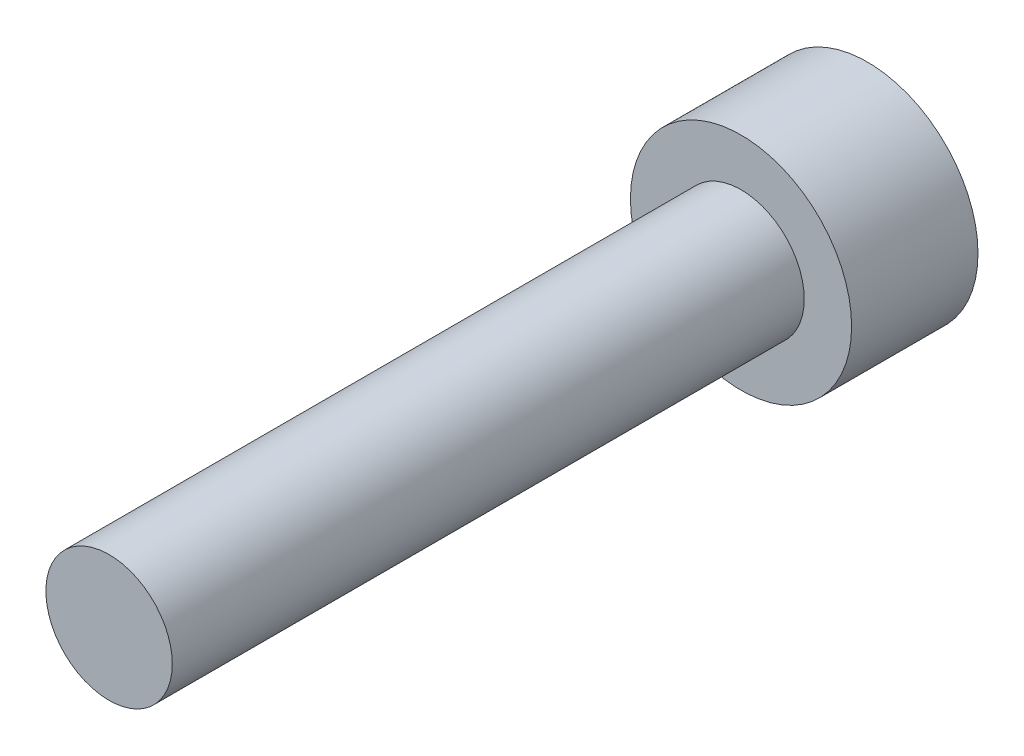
ISO-10303-21;
HEADER;
FILE_DESCRIPTION(('STEP AP214'),'2;1');
FILE_NAME('part.step','',(''),(''),'','','');
FILE_SCHEMA(('AUTOMOTIVE_DESIGN { 1 0 10303 214 1 1 1 1 }'));
ENDSEC;
DATA;
#1=APPLICATION_CONTEXT('core data for automotive mechanical design processes');
#2=APPLICATION_PROTOCOL_DEFINITION('international standard','automotive_design',2000,#1);
#3=PRODUCT_CONTEXT('',#1,'mechanical');
#4=PRODUCT('Part','Part','',(#3));
#5=PRODUCT_RELATED_PRODUCT_CATEGORY('part','',(#4));
#6=PRODUCT_DEFINITION_FORMATION('','',#4);
#7=PRODUCT_DEFINITION_CONTEXT('part definition',#1,'design');
#8=PRODUCT_DEFINITION('design','',#6,#7);
#9=PRODUCT_DEFINITION_SHAPE('','',#8);
#10=(LENGTH_UNIT() NAMED_UNIT(*) SI_UNIT(.MILLI.,.METRE.));
#11=(NAMED_UNIT(*) PLANE_ANGLE_UNIT() SI_UNIT($,.RADIAN.));
#12=(NAMED_UNIT(*) SI_UNIT($,.STERADIAN.) SOLID_ANGLE_UNIT());
#13=UNCERTAINTY_MEASURE_WITH_UNIT(LENGTH_MEASURE(1.E-05),#10,'distance_accuracy_value','');
#14=(GEOMETRIC_REPRESENTATION_CONTEXT(3) GLOBAL_UNCERTAINTY_ASSIGNED_CONTEXT((#13)) GLOBAL_UNIT_ASSIGNED_CONTEXT((#10,
#11,#12)) REPRESENTATION_CONTEXT('',''));
#15=CARTESIAN_POINT('',(0.,0.,0.));
#16=DIRECTION('',(0.,0.,1.));
#17=DIRECTION('',(1.,0.,0.));
#18=AXIS2_PLACEMENT_3D('',#15,#16,#17);
#19=CARTESIAN_POINT('',(0.,0.,20.));
#20=DIRECTION('',(0.,0.,1.));
#21=DIRECTION('',(1.,0.,0.));
#22=AXIS2_PLACEMENT_3D('',#19,#20,#21);
#23=PLANE('',#22);
#24=CARTESIAN_POINT('',(0.,0.,20.));
#25=DIRECTION('',(0.,0.,1.));
#26=DIRECTION('',(1.,0.,0.));
#27=AXIS2_PLACEMENT_3D('',#24,#25,#26);
#28=CIRCLE('',#27,2.);
#29=CARTESIAN_POINT('',(2.,0.,20.));
#30=VERTEX_POINT('',#29);
#31=EDGE_CURVE('E11',#30,#30,#28,.T.);
#32=ORIENTED_EDGE('',*,*,#31,.T.);
#33=EDGE_LOOP('',(#32));
#34=FACE_BOUND('',#33,.T.);
#35=ADVANCED_FACE('F37',(#34),#23,.T.);
#36=CARTESIAN_POINT('',(0.,0.,20.));
#37=DIRECTION('',(0.,0.,1.));
#38=DIRECTION('',(1.,0.,0.));
#39=AXIS2_PLACEMENT_3D('',#36,#37,#38);
#40=CYLINDRICAL_SURFACE('',#39,2.);
#41=CARTESIAN_POINT('',(0.,0.,0.));
#42=DIRECTION('',(0.,0.,1.));
#43=DIRECTION('',(1.,0.,0.));
#44=AXIS2_PLACEMENT_3D('',#41,#42,#43);
#45=CIRCLE('',#44,2.);
#46=CARTESIAN_POINT('',(2.,0.,0.));
#47=VERTEX_POINT('',#46);
#48=EDGE_CURVE('E44',#47,#47,#45,.T.);
#49=ORIENTED_EDGE('',*,*,#48,.T.);
#50=EDGE_LOOP('',(#49));
#51=FACE_BOUND('',#50,.T.);
#52=ORIENTED_EDGE('',*,*,#31,.F.);
#53=EDGE_LOOP('',(#52));
#54=FACE_BOUND('',#53,.T.);
#55=ADVANCED_FACE('F151',(#51,#54),#40,.T.);
#56=CARTESIAN_POINT('',(0.,-2.,0.));
#57=DIRECTION('',(0.,0.,1.));
#58=DIRECTION('',(1.,0.,0.));
#59=AXIS2_PLACEMENT_3D('',#56,#57,#58);
#60=PLANE('',#59);
#61=CARTESIAN_POINT('',(0.,0.,0.));
#62=DIRECTION('',(0.,0.,1.));
#63=DIRECTION('',(1.,0.,0.));
#64=AXIS2_PLACEMENT_3D('',#61,#62,#63);
#65=CIRCLE('',#64,3.5);
#66=CARTESIAN_POINT('',(3.5,0.,0.));
#67=VERTEX_POINT('',#66);
#68=EDGE_CURVE('E146',#67,#67,#65,.T.);
#69=ORIENTED_EDGE('',*,*,#68,.T.);
#70=EDGE_LOOP('',(#69));
#71=FACE_BOUND('',#70,.T.);
#72=ORIENTED_EDGE('',*,*,#48,.F.);
#73=EDGE_LOOP('',(#72));
#74=FACE_BOUND('',#73,.T.);
#75=ADVANCED_FACE('F154',(#71,#74),#60,.T.);
#76=CARTESIAN_POINT('',(0.,0.,20.));
#77=DIRECTION('',(0.,0.,1.));
#78=DIRECTION('',(1.,0.,0.));
#79=AXIS2_PLACEMENT_3D('',#76,#77,#78);
#80=CYLINDRICAL_SURFACE('',#79,3.5);
#81=CARTESIAN_POINT('',(0.,0.,-4.));
#82=DIRECTION('',(0.,0.,1.));
#83=DIRECTION('',(1.,0.,0.));
#84=AXIS2_PLACEMENT_3D('',#81,#82,#83);
#85=CIRCLE('',#84,3.5);
#86=CARTESIAN_POINT('',(3.5,0.,-4.));
#87=VERTEX_POINT('',#86);
#88=EDGE_CURVE('E138',#87,#87,#85,.T.);
#89=ORIENTED_EDGE('',*,*,#88,.T.);
#90=EDGE_LOOP('',(#89));
#91=FACE_BOUND('',#90,.T.);
#92=ORIENTED_EDGE('',*,*,#68,.F.);
#93=EDGE_LOOP('',(#92));
#94=FACE_BOUND('',#93,.T.);
#95=ADVANCED_FACE('F156',(#91,#94),#80,.T.);
#96=CARTESIAN_POINT('',(0.,-3.5,-4.));
#97=DIRECTION('',(0.,0.,-1.));
#98=DIRECTION('',(-1.,0.,0.));
#99=AXIS2_PLACEMENT_3D('',#96,#97,#98);
#100=PLANE('',#99);
#101=DIRECTION('',(0.866025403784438,-0.5,0.));
#102=VECTOR('',#101,1.);
#103=CARTESIAN_POINT('',(0.,1.73205080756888,-4.));
#104=LINE('',#103,#102);
#105=CARTESIAN_POINT('',(0.,1.73205080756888,-4.));
#106=VERTEX_POINT('',#105);
#107=CARTESIAN_POINT('',(1.5,0.866025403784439,-4.));
#108=VERTEX_POINT('',#107);
#109=EDGE_CURVE('E51',#106,#108,#104,.T.);
#110=ORIENTED_EDGE('',*,*,#109,.F.);
#111=DIRECTION('',(0.866025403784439,0.5,0.));
#112=VECTOR('',#111,1.);
#113=CARTESIAN_POINT('',(-1.5,0.866025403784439,-4.));
#114=LINE('',#113,#112);
#115=CARTESIAN_POINT('',(-1.5,0.866025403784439,-4.));
#116=VERTEX_POINT('',#115);
#117=EDGE_CURVE('E134',#116,#106,#114,.T.);
#118=ORIENTED_EDGE('',*,*,#117,.F.);
#119=DIRECTION('',(0.,1.,0.));
#120=VECTOR('',#119,1.);
#121=CARTESIAN_POINT('',(-1.5,-0.866025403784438,-4.));
#122=LINE('',#121,#120);
#123=CARTESIAN_POINT('',(-1.5,-0.866025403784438,-4.));
#124=VERTEX_POINT('',#123);
#125=EDGE_CURVE('E132',#124,#116,#122,.T.);
#126=ORIENTED_EDGE('',*,*,#125,.F.);
#127=DIRECTION('',(-0.866025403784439,0.5,0.));
#128=VECTOR('',#127,1.);
#129=CARTESIAN_POINT('',(0.,-1.73205080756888,-4.));
#130=LINE('',#129,#128);
#131=CARTESIAN_POINT('',(0.,-1.73205080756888,-4.));
#132=VERTEX_POINT('',#131);
#133=EDGE_CURVE('E99',#132,#124,#130,.T.);
#134=ORIENTED_EDGE('',*,*,#133,.F.);
#135=DIRECTION('',(-0.866025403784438,-0.5,0.));
#136=VECTOR('',#135,1.);
#137=CARTESIAN_POINT('',(1.5,-0.866025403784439,-4.));
#138=LINE('',#137,#136);
#139=CARTESIAN_POINT('',(1.5,-0.866025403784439,-4.));
#140=VERTEX_POINT('',#139);
#141=EDGE_CURVE('E128',#140,#132,#138,.T.);
#142=ORIENTED_EDGE('',*,*,#141,.F.);
#143=DIRECTION('',(0.,-1.,0.));
#144=VECTOR('',#143,1.);
#145=CARTESIAN_POINT('',(1.5,0.866025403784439,-4.));
#146=LINE('',#145,#144);
#147=EDGE_CURVE('E125',#108,#140,#146,.T.);
#148=ORIENTED_EDGE('',*,*,#147,.F.);
#149=EDGE_LOOP('',(#110,#118,#126,#134,#142,#148));
#150=FACE_BOUND('',#149,.T.);
#151=ORIENTED_EDGE('',*,*,#88,.F.);
#152=EDGE_LOOP('',(#151));
#153=FACE_BOUND('',#152,.T.);
#154=ADVANCED_FACE('F163',(#150,#153),#100,.T.);
#155=CARTESIAN_POINT('',(0.,1.73205080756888,-1.));
#156=DIRECTION('',(0.5,0.866025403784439,0.));
#157=DIRECTION('',(-0.866025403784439,0.5,0.));
#158=AXIS2_PLACEMENT_3D('',#155,#156,#157);
#159=PLANE('',#158);
#160=ORIENTED_EDGE('',*,*,#109,.T.);
#161=DIRECTION('',(0.,0.,-1.));
#162=VECTOR('',#161,1.);
#163=CARTESIAN_POINT('',(1.5,0.866025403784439,-1.));
#164=LINE('',#163,#162);
#165=CARTESIAN_POINT('',(1.5,0.866025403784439,-1.));
#166=VERTEX_POINT('',#165);
#167=EDGE_CURVE('E81',#166,#108,#164,.T.);
#168=ORIENTED_EDGE('',*,*,#167,.F.);
#169=DIRECTION('',(0.866025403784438,-0.5,0.));
#170=VECTOR('',#169,1.);
#171=CARTESIAN_POINT('',(0.,1.73205080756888,-1.));
#172=LINE('',#171,#170);
#173=CARTESIAN_POINT('',(0.,1.73205080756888,-1.));
#174=VERTEX_POINT('',#173);
#175=EDGE_CURVE('E136',#174,#166,#172,.T.);
#176=ORIENTED_EDGE('',*,*,#175,.F.);
#177=DIRECTION('',(0.,0.,-1.));
#178=VECTOR('',#177,1.);
#179=CARTESIAN_POINT('',(0.,1.73205080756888,-1.));
#180=LINE('',#179,#178);
#181=EDGE_CURVE('E59',#174,#106,#180,.T.);
#182=ORIENTED_EDGE('',*,*,#181,.T.);
#183=EDGE_LOOP('',(#160,#168,#176,#182));
#184=FACE_BOUND('',#183,.T.);
#185=ADVANCED_FACE('F197',(#184),#159,.F.);
#186=CARTESIAN_POINT('',(-1.5,0.866025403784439,-1.));
#187=DIRECTION('',(-0.5,0.866025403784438,0.));
#188=DIRECTION('',(-0.866025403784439,-0.5,0.));
#189=AXIS2_PLACEMENT_3D('',#186,#187,#188);
#190=PLANE('',#189);
#191=ORIENTED_EDGE('',*,*,#117,.T.);
#192=ORIENTED_EDGE('',*,*,#181,.F.);
#193=DIRECTION('',(0.866025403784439,0.5,0.));
#194=VECTOR('',#193,1.);
#195=CARTESIAN_POINT('',(-1.5,0.866025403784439,-1.));
#196=LINE('',#195,#194);
#197=CARTESIAN_POINT('',(-1.5,0.866025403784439,-1.));
#198=VERTEX_POINT('',#197);
#199=EDGE_CURVE('E111',#198,#174,#196,.T.);
#200=ORIENTED_EDGE('',*,*,#199,.F.);
#201=DIRECTION('',(0.,0.,-1.));
#202=VECTOR('',#201,1.);
#203=CARTESIAN_POINT('',(-1.5,0.866025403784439,-1.));
#204=LINE('',#203,#202);
#205=EDGE_CURVE('E103',#198,#116,#204,.T.);
#206=ORIENTED_EDGE('',*,*,#205,.T.);
#207=EDGE_LOOP('',(#191,#192,#200,#206));
#208=FACE_BOUND('',#207,.T.);
#209=ADVANCED_FACE('F208',(#208),#190,.F.);
#210=CARTESIAN_POINT('',(-1.5,-0.866025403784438,-1.));
#211=DIRECTION('',(-1.,0.,0.));
#212=DIRECTION('',(0.,0.,1.));
#213=AXIS2_PLACEMENT_3D('',#210,#211,#212);
#214=PLANE('',#213);
#215=ORIENTED_EDGE('',*,*,#125,.T.);
#216=ORIENTED_EDGE('',*,*,#205,.F.);
#217=DIRECTION('',(0.,1.,0.));
#218=VECTOR('',#217,1.);
#219=CARTESIAN_POINT('',(-1.5,-0.866025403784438,-1.));
#220=LINE('',#219,#218);
#221=CARTESIAN_POINT('',(-1.5,-0.866025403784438,-1.));
#222=VERTEX_POINT('',#221);
#223=EDGE_CURVE('E107',#222,#198,#220,.T.);
#224=ORIENTED_EDGE('',*,*,#223,.F.);
#225=DIRECTION('',(0.,0.,-1.));
#226=VECTOR('',#225,1.);
#227=CARTESIAN_POINT('',(-1.5,-0.866025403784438,-1.));
#228=LINE('',#227,#226);
#229=EDGE_CURVE('E92',#222,#124,#228,.T.);
#230=ORIENTED_EDGE('',*,*,#229,.T.);
#231=EDGE_LOOP('',(#215,#216,#224,#230));
#232=FACE_BOUND('',#231,.T.);
#233=ADVANCED_FACE('F108',(#232),#214,.F.);
#234=CARTESIAN_POINT('',(0.,-1.73205080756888,-1.));
#235=DIRECTION('',(-0.5,-0.866025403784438,0.));
#236=DIRECTION('',(0.866025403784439,-0.5,0.));
#237=AXIS2_PLACEMENT_3D('',#234,#235,#236);
#238=PLANE('',#237);
#239=ORIENTED_EDGE('',*,*,#133,.T.);
#240=ORIENTED_EDGE('',*,*,#229,.F.);
#241=DIRECTION('',(-0.866025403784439,0.5,0.));
#242=VECTOR('',#241,1.);
#243=CARTESIAN_POINT('',(0.,-1.73205080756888,-1.));
#244=LINE('',#243,#242);
#245=CARTESIAN_POINT('',(0.,-1.73205080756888,-1.));
#246=VERTEX_POINT('',#245);
#247=EDGE_CURVE('E96',#246,#222,#244,.T.);
#248=ORIENTED_EDGE('',*,*,#247,.F.);
#249=DIRECTION('',(0.,0.,-1.));
#250=VECTOR('',#249,1.);
#251=CARTESIAN_POINT('',(0.,-1.73205080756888,-1.));
#252=LINE('',#251,#250);
#253=EDGE_CURVE('E104',#246,#132,#252,.T.);
#254=ORIENTED_EDGE('',*,*,#253,.T.);
#255=EDGE_LOOP('',(#239,#240,#248,#254));
#256=FACE_BOUND('',#255,.T.);
#257=ADVANCED_FACE('F94',(#256),#238,.F.);
#258=CARTESIAN_POINT('',(1.5,-0.866025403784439,-1.));
#259=DIRECTION('',(0.5,-0.866025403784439,0.));
#260=DIRECTION('',(0.866025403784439,0.5,0.));
#261=AXIS2_PLACEMENT_3D('',#258,#259,#260);
#262=PLANE('',#261);
#263=ORIENTED_EDGE('',*,*,#141,.T.);
#264=ORIENTED_EDGE('',*,*,#253,.F.);
#265=DIRECTION('',(-0.866025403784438,-0.5,0.));
#266=VECTOR('',#265,1.);
#267=CARTESIAN_POINT('',(1.5,-0.866025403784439,-1.));
#268=LINE('',#267,#266);
#269=CARTESIAN_POINT('',(1.5,-0.866025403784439,-1.));
#270=VERTEX_POINT('',#269);
#271=EDGE_CURVE('E117',#270,#246,#268,.T.);
#272=ORIENTED_EDGE('',*,*,#271,.F.);
#273=DIRECTION('',(0.,0.,-1.));
#274=VECTOR('',#273,1.);
#275=CARTESIAN_POINT('',(1.5,-0.866025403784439,-1.));
#276=LINE('',#275,#274);
#277=EDGE_CURVE('E141',#270,#140,#276,.T.);
#278=ORIENTED_EDGE('',*,*,#277,.T.);
#279=EDGE_LOOP('',(#263,#264,#272,#278));
#280=FACE_BOUND('',#279,.T.);
#281=ADVANCED_FACE('F236',(#280),#262,.F.);
#282=CARTESIAN_POINT('',(1.5,0.866025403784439,-1.));
#283=DIRECTION('',(1.,0.,0.));
#284=DIRECTION('',(0.,0.,-1.));
#285=AXIS2_PLACEMENT_3D('',#282,#283,#284);
#286=PLANE('',#285);
#287=ORIENTED_EDGE('',*,*,#147,.T.);
#288=ORIENTED_EDGE('',*,*,#277,.F.);
#289=DIRECTION('',(0.,-1.,0.));
#290=VECTOR('',#289,1.);
#291=CARTESIAN_POINT('',(1.5,0.866025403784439,-1.));
#292=LINE('',#291,#290);
#293=EDGE_CURVE('E119',#166,#270,#292,.T.);
#294=ORIENTED_EDGE('',*,*,#293,.F.);
#295=ORIENTED_EDGE('',*,*,#167,.T.);
#296=EDGE_LOOP('',(#287,#288,#294,#295));
#297=FACE_BOUND('',#296,.T.);
#298=ADVANCED_FACE('F246',(#297),#286,.F.);
#299=CARTESIAN_POINT('',(3.,0.,-1.));
#300=DIRECTION('',(0.,0.,-1.));
#301=DIRECTION('',(-1.,0.,0.));
#302=AXIS2_PLACEMENT_3D('',#299,#300,#301);
#303=PLANE('',#302);
#304=ORIENTED_EDGE('',*,*,#175,.T.);
#305=ORIENTED_EDGE('',*,*,#293,.T.);
#306=ORIENTED_EDGE('',*,*,#271,.T.);
#307=ORIENTED_EDGE('',*,*,#247,.T.);
#308=ORIENTED_EDGE('',*,*,#223,.T.);
#309=ORIENTED_EDGE('',*,*,#199,.T.);
#310=EDGE_LOOP('',(#304,#305,#306,#307,#308,#309));
#311=FACE_BOUND('',#310,.T.);
#312=ADVANCED_FACE('F114',(#311),#303,.T.);
#313=CLOSED_SHELL('',(#35,#55,#75,#95,#154,#185,#209,#233,#257,#281,#298,#312));
#314=MANIFOLD_SOLID_BREP('B2',#313);
#315=ADVANCED_BREP_SHAPE_REPRESENTATION('',(#18,#314),#14);
#316=SHAPE_DEFINITION_REPRESENTATION(#9,#315);
ENDSEC;
END-ISO-10303-21;
